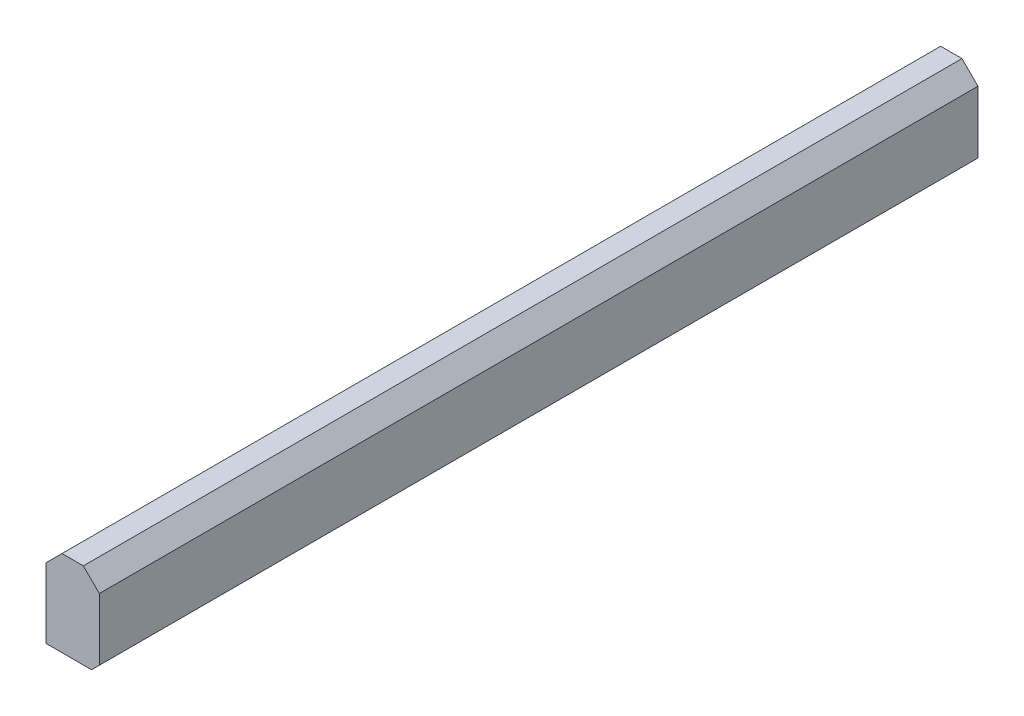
from build123d import *

# Parameters (mm, degrees)
SKETCH2_W           = 188.214
SKETCH2_H           = 116.84
BOSS_EXTRUDE1_DEPTH = 962.69097766
CHAMFER1_SIZE       = 17
CHAMFER2_SIZE       = 35


with BuildPart() as part:
    # Sketch2 → Boss-Extrude1 (new, symmetric)
    with BuildSketch(Plane(origin=(0, 0, 0), x_dir=(0, 1, 0), z_dir=(0, 0, 1))):
        Rectangle(SKETCH2_W, SKETCH2_H)
    extrude(amount=BOSS_EXTRUDE1_DEPTH, both=True)

    # Chamfer1
    chamfer1_edges = [part.edges().sort_by_distance(p)[0] for p in [
        (58.42, -94.107, 0),
    ]]
    chamfer(chamfer1_edges, length=CHAMFER1_SIZE)

    # Chamfer2
    chamfer2_edges = [part.edges().sort_by_distance(p)[0] for p in [
        (58.42, 94.107, 0),
        (-58.42, 94.107, 0),
    ]]
    chamfer(chamfer2_edges, length=CHAMFER2_SIZE)


solid = part.part
